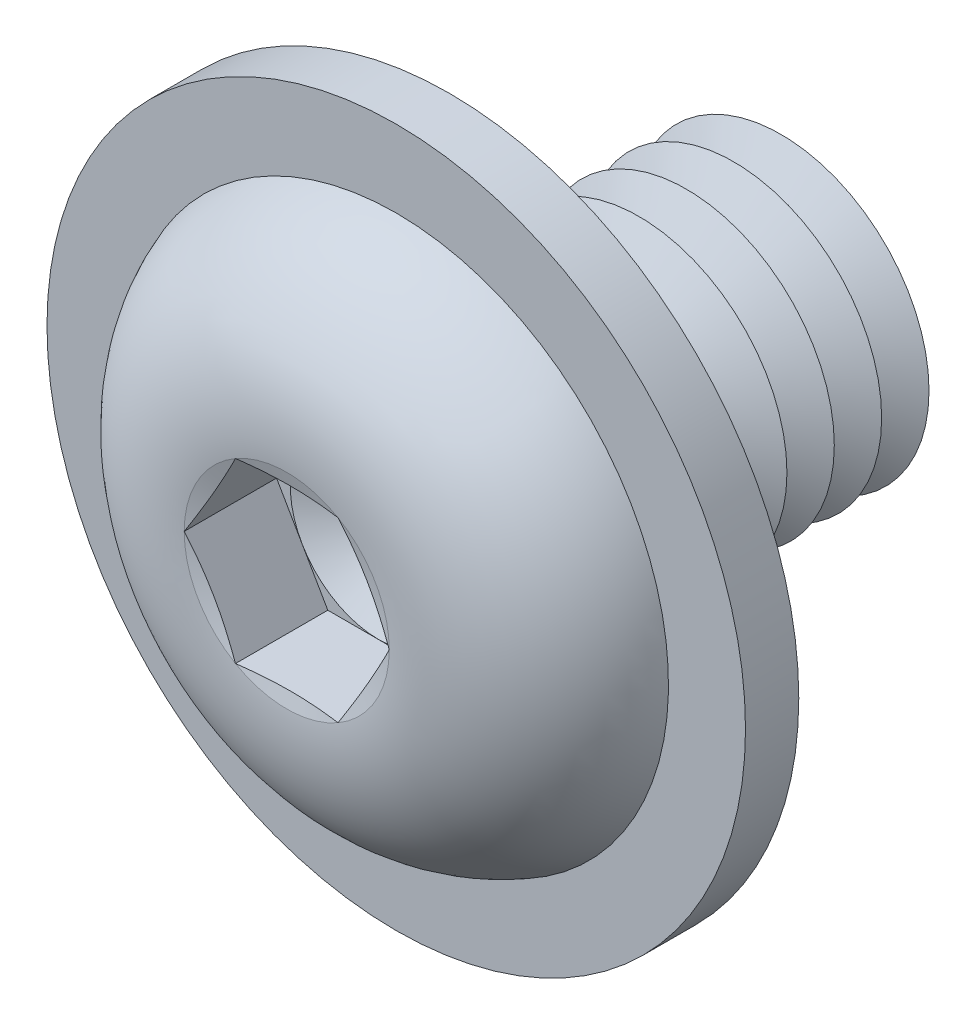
ISO-10303-21;
HEADER;
FILE_DESCRIPTION(('STEP AP214'),'2;1');
FILE_NAME('part.step','',(''),(''),'','','');
FILE_SCHEMA(('AUTOMOTIVE_DESIGN { 1 0 10303 214 1 1 1 1 }'));
ENDSEC;
DATA;
#1=APPLICATION_CONTEXT('core data for automotive mechanical design processes');
#2=APPLICATION_PROTOCOL_DEFINITION('international standard','automotive_design',2000,#1);
#3=PRODUCT_CONTEXT('',#1,'mechanical');
#4=PRODUCT('Part','Part','',(#3));
#5=PRODUCT_RELATED_PRODUCT_CATEGORY('part','',(#4));
#6=PRODUCT_DEFINITION_FORMATION('','',#4);
#7=PRODUCT_DEFINITION_CONTEXT('part definition',#1,'design');
#8=PRODUCT_DEFINITION('design','',#6,#7);
#9=PRODUCT_DEFINITION_SHAPE('','',#8);
#10=(LENGTH_UNIT() NAMED_UNIT(*) SI_UNIT(.MILLI.,.METRE.));
#11=(NAMED_UNIT(*) PLANE_ANGLE_UNIT() SI_UNIT($,.RADIAN.));
#12=(NAMED_UNIT(*) SI_UNIT($,.STERADIAN.) SOLID_ANGLE_UNIT());
#13=UNCERTAINTY_MEASURE_WITH_UNIT(LENGTH_MEASURE(1.E-05),#10,'distance_accuracy_value','');
#14=(GEOMETRIC_REPRESENTATION_CONTEXT(3) GLOBAL_UNCERTAINTY_ASSIGNED_CONTEXT((#13)) GLOBAL_UNIT_ASSIGNED_CONTEXT((#10,
#11,#12)) REPRESENTATION_CONTEXT('',''));
#15=CARTESIAN_POINT('',(0.,0.,0.));
#16=DIRECTION('',(0.,0.,1.));
#17=DIRECTION('',(1.,0.,0.));
#18=AXIS2_PLACEMENT_3D('',#15,#16,#17);
#19=CARTESIAN_POINT('',(0.,0.,-3.2));
#20=DIRECTION('',(0.,0.,1.));
#21=DIRECTION('',(1.,0.,0.));
#22=AXIS2_PLACEMENT_3D('',#19,#20,#21);
#23=CONICAL_SURFACE('',#22,2.5,1.0471975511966);
#24=CARTESIAN_POINT('',(0.,0.,-3.6));
#25=DIRECTION('',(0.,0.,1.));
#26=DIRECTION('',(1.,0.,0.));
#27=AXIS2_PLACEMENT_3D('',#24,#25,#26);
#28=CIRCLE('',#27,1.80717967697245);
#29=CARTESIAN_POINT('',(1.80717967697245,0.,-3.6));
#30=VERTEX_POINT('',#29);
#31=EDGE_CURVE('E265',#30,#30,#28,.T.);
#32=ORIENTED_EDGE('',*,*,#31,.T.);
#33=EDGE_LOOP('',(#32));
#34=FACE_BOUND('',#33,.T.);
#35=CARTESIAN_POINT('',(0.,0.,-3.2));
#36=DIRECTION('',(0.,0.,1.));
#37=DIRECTION('',(1.,0.,0.));
#38=AXIS2_PLACEMENT_3D('',#35,#36,#37);
#39=CIRCLE('',#38,2.5);
#40=CARTESIAN_POINT('',(2.5,0.,-3.2));
#41=VERTEX_POINT('',#40);
#42=EDGE_CURVE('E261',#41,#41,#39,.T.);
#43=ORIENTED_EDGE('',*,*,#42,.F.);
#44=EDGE_LOOP('',(#43));
#45=FACE_BOUND('',#44,.T.);
#46=ADVANCED_FACE('F39',(#34,#45),#23,.T.);
#47=CARTESIAN_POINT('',(0.,0.,-3.6));
#48=DIRECTION('',(0.,0.,-1.));
#49=DIRECTION('',(-1.,0.,0.));
#50=AXIS2_PLACEMENT_3D('',#47,#48,#49);
#51=CONICAL_SURFACE('',#50,1.80717967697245,1.0471975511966);
#52=CARTESIAN_POINT('',(0.,0.,-4.));
#53=DIRECTION('',(0.,0.,1.));
#54=DIRECTION('',(1.,0.,0.));
#55=AXIS2_PLACEMENT_3D('',#52,#53,#54);
#56=CIRCLE('',#55,2.5);
#57=CARTESIAN_POINT('',(2.5,0.,-4.));
#58=VERTEX_POINT('',#57);
#59=EDGE_CURVE('E269',#58,#58,#56,.T.);
#60=ORIENTED_EDGE('',*,*,#59,.T.);
#61=EDGE_LOOP('',(#60));
#62=FACE_BOUND('',#61,.T.);
#63=ORIENTED_EDGE('',*,*,#31,.F.);
#64=EDGE_LOOP('',(#63));
#65=FACE_BOUND('',#64,.T.);
#66=ADVANCED_FACE('F390',(#62,#65),#51,.T.);
#67=CARTESIAN_POINT('',(0.,2.5,-6.));
#68=DIRECTION('',(0.,0.,-1.));
#69=DIRECTION('',(-1.,0.,0.));
#70=AXIS2_PLACEMENT_3D('',#67,#68,#69);
#71=PLANE('',#70);
#72=CARTESIAN_POINT('',(0.,0.,-6.));
#73=DIRECTION('',(0.,0.,1.));
#74=DIRECTION('',(1.,0.,0.));
#75=AXIS2_PLACEMENT_3D('',#72,#73,#74);
#76=CIRCLE('',#75,1.80717967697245);
#77=CARTESIAN_POINT('',(1.80717967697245,0.,-6.));
#78=VERTEX_POINT('',#77);
#79=EDGE_CURVE('E289',#78,#78,#76,.T.);
#80=ORIENTED_EDGE('',*,*,#79,.F.);
#81=EDGE_LOOP('',(#80));
#82=FACE_BOUND('',#81,.T.);
#83=ADVANCED_FACE('F396',(#82),#71,.T.);
#84=CARTESIAN_POINT('',(0.,0.,-5.6));
#85=DIRECTION('',(0.,0.,1.));
#86=DIRECTION('',(1.,0.,0.));
#87=AXIS2_PLACEMENT_3D('',#84,#85,#86);
#88=CONICAL_SURFACE('',#87,2.5,1.0471975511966);
#89=ORIENTED_EDGE('',*,*,#79,.T.);
#90=EDGE_LOOP('',(#89));
#91=FACE_BOUND('',#90,.T.);
#92=CARTESIAN_POINT('',(0.,0.,-5.6));
#93=DIRECTION('',(0.,0.,1.));
#94=DIRECTION('',(1.,0.,0.));
#95=AXIS2_PLACEMENT_3D('',#92,#93,#94);
#96=CIRCLE('',#95,2.5);
#97=CARTESIAN_POINT('',(2.5,0.,-5.6));
#98=VERTEX_POINT('',#97);
#99=EDGE_CURVE('E285',#98,#98,#96,.T.);
#100=ORIENTED_EDGE('',*,*,#99,.F.);
#101=EDGE_LOOP('',(#100));
#102=FACE_BOUND('',#101,.T.);
#103=ADVANCED_FACE('F415',(#91,#102),#88,.T.);
#104=CARTESIAN_POINT('',(0.,0.,-5.2));
#105=DIRECTION('',(0.,0.,-1.));
#106=DIRECTION('',(-1.,0.,0.));
#107=AXIS2_PLACEMENT_3D('',#104,#105,#106);
#108=CONICAL_SURFACE('',#107,1.80717967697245,1.0471975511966);
#109=ORIENTED_EDGE('',*,*,#99,.T.);
#110=EDGE_LOOP('',(#109));
#111=FACE_BOUND('',#110,.T.);
#112=CARTESIAN_POINT('',(0.,0.,-5.2));
#113=DIRECTION('',(0.,0.,1.));
#114=DIRECTION('',(1.,0.,0.));
#115=AXIS2_PLACEMENT_3D('',#112,#113,#114);
#116=CIRCLE('',#115,1.80717967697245);
#117=CARTESIAN_POINT('',(1.80717967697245,0.,-5.2));
#118=VERTEX_POINT('',#117);
#119=EDGE_CURVE('E281',#118,#118,#116,.T.);
#120=ORIENTED_EDGE('',*,*,#119,.F.);
#121=EDGE_LOOP('',(#120));
#122=FACE_BOUND('',#121,.T.);
#123=ADVANCED_FACE('F412',(#111,#122),#108,.T.);
#124=CARTESIAN_POINT('',(0.,0.,-4.8));
#125=DIRECTION('',(0.,0.,1.));
#126=DIRECTION('',(1.,0.,0.));
#127=AXIS2_PLACEMENT_3D('',#124,#125,#126);
#128=CONICAL_SURFACE('',#127,2.5,1.0471975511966);
#129=ORIENTED_EDGE('',*,*,#119,.T.);
#130=EDGE_LOOP('',(#129));
#131=FACE_BOUND('',#130,.T.);
#132=CARTESIAN_POINT('',(0.,0.,-4.8));
#133=DIRECTION('',(0.,0.,1.));
#134=DIRECTION('',(1.,0.,0.));
#135=AXIS2_PLACEMENT_3D('',#132,#133,#134);
#136=CIRCLE('',#135,2.5);
#137=CARTESIAN_POINT('',(2.5,0.,-4.8));
#138=VERTEX_POINT('',#137);
#139=EDGE_CURVE('E277',#138,#138,#136,.T.);
#140=ORIENTED_EDGE('',*,*,#139,.F.);
#141=EDGE_LOOP('',(#140));
#142=FACE_BOUND('',#141,.T.);
#143=ADVANCED_FACE('F406',(#131,#142),#128,.T.);
#144=CARTESIAN_POINT('',(0.,0.,-4.4));
#145=DIRECTION('',(0.,0.,-1.));
#146=DIRECTION('',(-1.,0.,0.));
#147=AXIS2_PLACEMENT_3D('',#144,#145,#146);
#148=CONICAL_SURFACE('',#147,1.80717967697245,1.0471975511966);
#149=ORIENTED_EDGE('',*,*,#139,.T.);
#150=EDGE_LOOP('',(#149));
#151=FACE_BOUND('',#150,.T.);
#152=CARTESIAN_POINT('',(0.,0.,-4.4));
#153=DIRECTION('',(0.,0.,1.));
#154=DIRECTION('',(1.,0.,0.));
#155=AXIS2_PLACEMENT_3D('',#152,#153,#154);
#156=CIRCLE('',#155,1.80717967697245);
#157=CARTESIAN_POINT('',(1.80717967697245,0.,-4.4));
#158=VERTEX_POINT('',#157);
#159=EDGE_CURVE('E273',#158,#158,#156,.T.);
#160=ORIENTED_EDGE('',*,*,#159,.F.);
#161=EDGE_LOOP('',(#160));
#162=FACE_BOUND('',#161,.T.);
#163=ADVANCED_FACE('F402',(#151,#162),#148,.T.);
#164=CARTESIAN_POINT('',(0.,0.,-4.));
#165=DIRECTION('',(0.,0.,1.));
#166=DIRECTION('',(1.,0.,0.));
#167=AXIS2_PLACEMENT_3D('',#164,#165,#166);
#168=CONICAL_SURFACE('',#167,2.5,1.0471975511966);
#169=ORIENTED_EDGE('',*,*,#159,.T.);
#170=EDGE_LOOP('',(#169));
#171=FACE_BOUND('',#170,.T.);
#172=ORIENTED_EDGE('',*,*,#59,.F.);
#173=EDGE_LOOP('',(#172));
#174=FACE_BOUND('',#173,.T.);
#175=ADVANCED_FACE('F405',(#171,#174),#168,.T.);
#176=CARTESIAN_POINT('',(0.,0.,-2.4));
#177=DIRECTION('',(0.,0.,1.));
#178=DIRECTION('',(1.,0.,0.));
#179=AXIS2_PLACEMENT_3D('',#176,#177,#178);
#180=CONICAL_SURFACE('',#179,2.5,1.0471975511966);
#181=CARTESIAN_POINT('',(0.,0.,-2.8));
#182=DIRECTION('',(0.,0.,1.));
#183=DIRECTION('',(1.,0.,0.));
#184=AXIS2_PLACEMENT_3D('',#181,#182,#183);
#185=CIRCLE('',#184,1.80717967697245);
#186=CARTESIAN_POINT('',(1.80717967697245,0.,-2.8));
#187=VERTEX_POINT('',#186);
#188=EDGE_CURVE('E257',#187,#187,#185,.T.);
#189=ORIENTED_EDGE('',*,*,#188,.T.);
#190=EDGE_LOOP('',(#189));
#191=FACE_BOUND('',#190,.T.);
#192=CARTESIAN_POINT('',(0.,0.,-2.4));
#193=DIRECTION('',(0.,0.,1.));
#194=DIRECTION('',(1.,0.,0.));
#195=AXIS2_PLACEMENT_3D('',#192,#193,#194);
#196=CIRCLE('',#195,2.5);
#197=CARTESIAN_POINT('',(2.5,0.,-2.4));
#198=VERTEX_POINT('',#197);
#199=EDGE_CURVE('E253',#198,#198,#196,.T.);
#200=ORIENTED_EDGE('',*,*,#199,.F.);
#201=EDGE_LOOP('',(#200));
#202=FACE_BOUND('',#201,.T.);
#203=ADVANCED_FACE('F410',(#191,#202),#180,.T.);
#204=CARTESIAN_POINT('',(0.,0.,-2.8));
#205=DIRECTION('',(0.,0.,-1.));
#206=DIRECTION('',(-1.,0.,0.));
#207=AXIS2_PLACEMENT_3D('',#204,#205,#206);
#208=CONICAL_SURFACE('',#207,1.80717967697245,1.0471975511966);
#209=ORIENTED_EDGE('',*,*,#42,.T.);
#210=EDGE_LOOP('',(#209));
#211=FACE_BOUND('',#210,.T.);
#212=ORIENTED_EDGE('',*,*,#188,.F.);
#213=EDGE_LOOP('',(#212));
#214=FACE_BOUND('',#213,.T.);
#215=ADVANCED_FACE('F461',(#211,#214),#208,.T.);
#216=CARTESIAN_POINT('',(0.,0.,-1.6));
#217=DIRECTION('',(0.,0.,1.));
#218=DIRECTION('',(1.,0.,0.));
#219=AXIS2_PLACEMENT_3D('',#216,#217,#218);
#220=CONICAL_SURFACE('',#219,2.5,1.0471975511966);
#221=CARTESIAN_POINT('',(0.,0.,-2.));
#222=DIRECTION('',(0.,0.,1.));
#223=DIRECTION('',(1.,0.,0.));
#224=AXIS2_PLACEMENT_3D('',#221,#222,#223);
#225=CIRCLE('',#224,1.80717967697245);
#226=CARTESIAN_POINT('',(1.80717967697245,0.,-2.));
#227=VERTEX_POINT('',#226);
#228=EDGE_CURVE('E249',#227,#227,#225,.T.);
#229=ORIENTED_EDGE('',*,*,#228,.T.);
#230=EDGE_LOOP('',(#229));
#231=FACE_BOUND('',#230,.T.);
#232=CARTESIAN_POINT('',(0.,0.,-1.6));
#233=DIRECTION('',(0.,0.,1.));
#234=DIRECTION('',(1.,0.,0.));
#235=AXIS2_PLACEMENT_3D('',#232,#233,#234);
#236=CIRCLE('',#235,2.5);
#237=CARTESIAN_POINT('',(2.5,0.,-1.6));
#238=VERTEX_POINT('',#237);
#239=EDGE_CURVE('E241',#238,#238,#236,.T.);
#240=ORIENTED_EDGE('',*,*,#239,.F.);
#241=EDGE_LOOP('',(#240));
#242=FACE_BOUND('',#241,.T.);
#243=ADVANCED_FACE('F467',(#231,#242),#220,.T.);
#244=CARTESIAN_POINT('',(0.,0.,-2.));
#245=DIRECTION('',(0.,0.,-1.));
#246=DIRECTION('',(-1.,0.,0.));
#247=AXIS2_PLACEMENT_3D('',#244,#245,#246);
#248=CONICAL_SURFACE('',#247,1.80717967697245,1.0471975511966);
#249=ORIENTED_EDGE('',*,*,#199,.T.);
#250=EDGE_LOOP('',(#249));
#251=FACE_BOUND('',#250,.T.);
#252=ORIENTED_EDGE('',*,*,#228,.F.);
#253=EDGE_LOOP('',(#252));
#254=FACE_BOUND('',#253,.T.);
#255=ADVANCED_FACE('F474',(#251,#254),#248,.T.);
#256=CARTESIAN_POINT('',(0.,0.,-0.799999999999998));
#257=DIRECTION('',(0.,0.,1.));
#258=DIRECTION('',(1.,0.,0.));
#259=AXIS2_PLACEMENT_3D('',#256,#257,#258);
#260=CONICAL_SURFACE('',#259,2.5,1.0471975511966);
#261=CARTESIAN_POINT('',(0.,0.,-1.2));
#262=DIRECTION('',(0.,0.,1.));
#263=DIRECTION('',(1.,0.,0.));
#264=AXIS2_PLACEMENT_3D('',#261,#262,#263);
#265=CIRCLE('',#264,1.80717967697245);
#266=CARTESIAN_POINT('',(1.80717967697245,0.,-1.2));
#267=VERTEX_POINT('',#266);
#268=EDGE_CURVE('E230',#267,#267,#265,.T.);
#269=ORIENTED_EDGE('',*,*,#268,.T.);
#270=EDGE_LOOP('',(#269));
#271=FACE_BOUND('',#270,.T.);
#272=CARTESIAN_POINT('',(0.,0.,-0.799999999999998));
#273=DIRECTION('',(0.,0.,1.));
#274=DIRECTION('',(1.,0.,0.));
#275=AXIS2_PLACEMENT_3D('',#272,#273,#274);
#276=CIRCLE('',#275,2.5);
#277=CARTESIAN_POINT('',(2.5,0.,-0.799999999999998));
#278=VERTEX_POINT('',#277);
#279=EDGE_CURVE('E245',#278,#278,#276,.T.);
#280=ORIENTED_EDGE('',*,*,#279,.F.);
#281=EDGE_LOOP('',(#280));
#282=FACE_BOUND('',#281,.T.);
#283=ADVANCED_FACE('F481',(#271,#282),#260,.T.);
#284=CARTESIAN_POINT('',(0.,0.,-1.2));
#285=DIRECTION('',(0.,0.,-1.));
#286=DIRECTION('',(-1.,0.,0.));
#287=AXIS2_PLACEMENT_3D('',#284,#285,#286);
#288=CONICAL_SURFACE('',#287,1.80717967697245,1.0471975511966);
#289=ORIENTED_EDGE('',*,*,#239,.T.);
#290=EDGE_LOOP('',(#289));
#291=FACE_BOUND('',#290,.T.);
#292=ORIENTED_EDGE('',*,*,#268,.F.);
#293=EDGE_LOOP('',(#292));
#294=FACE_BOUND('',#293,.T.);
#295=ADVANCED_FACE('F219',(#291,#294),#288,.T.);
#296=CARTESIAN_POINT('',(0.,2.5,0.));
#297=DIRECTION('',(0.,0.,-1.));
#298=DIRECTION('',(-1.,0.,0.));
#299=AXIS2_PLACEMENT_3D('',#296,#297,#298);
#300=PLANE('',#299);
#301=CARTESIAN_POINT('',(0.,0.,0.));
#302=DIRECTION('',(0.,0.,-1.));
#303=DIRECTION('',(-1.,0.,0.));
#304=AXIS2_PLACEMENT_3D('',#301,#302,#303);
#305=CIRCLE('',#304,2.9);
#306=CARTESIAN_POINT('',(-2.9,0.,0.));
#307=VERTEX_POINT('',#306);
#308=EDGE_CURVE('E303',#307,#307,#305,.F.);
#309=ORIENTED_EDGE('',*,*,#308,.T.);
#310=EDGE_LOOP('',(#309));
#311=FACE_BOUND('',#310,.T.);
#312=CARTESIAN_POINT('',(0.,0.,0.));
#313=DIRECTION('',(0.,0.,-1.));
#314=DIRECTION('',(0.,1.,0.));
#315=AXIS2_PLACEMENT_3D('',#312,#313,#314);
#316=CIRCLE('',#315,5.9);
#317=CARTESIAN_POINT('',(0.,5.9,0.));
#318=VERTEX_POINT('',#317);
#319=EDGE_CURVE('E366',#318,#318,#316,.T.);
#320=ORIENTED_EDGE('',*,*,#319,.T.);
#321=EDGE_LOOP('',(#320));
#322=FACE_BOUND('',#321,.T.);
#323=ADVANCED_FACE('F376',(#311,#322),#300,.T.);
#324=CARTESIAN_POINT('',(0.,0.,-0.399999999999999));
#325=DIRECTION('',(0.,0.,-1.));
#326=DIRECTION('',(-1.,0.,0.));
#327=AXIS2_PLACEMENT_3D('',#324,#325,#326);
#328=TOROIDAL_SURFACE('',#327,2.9,0.4);
#329=ORIENTED_EDGE('',*,*,#308,.F.);
#330=EDGE_LOOP('',(#329));
#331=FACE_BOUND('',#330,.T.);
#332=CARTESIAN_POINT('',(0.,0.,-0.399999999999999));
#333=DIRECTION('',(0.,0.,-1.));
#334=DIRECTION('',(-1.,0.,0.));
#335=AXIS2_PLACEMENT_3D('',#332,#333,#334);
#336=CIRCLE('',#335,2.5);
#337=CARTESIAN_POINT('',(-2.5,0.,-0.399999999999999));
#338=VERTEX_POINT('',#337);
#339=EDGE_CURVE('E298',#338,#338,#336,.T.);
#340=ORIENTED_EDGE('',*,*,#339,.F.);
#341=EDGE_LOOP('',(#340));
#342=FACE_BOUND('',#341,.T.);
#343=ADVANCED_FACE('F41',(#331,#342),#328,.F.);
#344=CARTESIAN_POINT('',(0.,0.,-6.));
#345=DIRECTION('',(0.,0.,-1.));
#346=DIRECTION('',(-1.,0.,0.));
#347=AXIS2_PLACEMENT_3D('',#344,#345,#346);
#348=CYLINDRICAL_SURFACE('',#347,2.5);
#349=ORIENTED_EDGE('',*,*,#339,.T.);
#350=EDGE_LOOP('',(#349));
#351=FACE_BOUND('',#350,.T.);
#352=ORIENTED_EDGE('',*,*,#279,.T.);
#353=EDGE_LOOP('',(#352));
#354=FACE_BOUND('',#353,.T.);
#355=ADVANCED_FACE('F380',(#351,#354),#348,.T.);
#356=CARTESIAN_POINT('',(0.,0.,0.9));
#357=DIRECTION('',(0.,0.,-1.));
#358=DIRECTION('',(0.,1.,0.));
#359=AXIS2_PLACEMENT_3D('',#356,#357,#358);
#360=CYLINDRICAL_SURFACE('',#359,5.9);
#361=CARTESIAN_POINT('',(0.,0.,0.9));
#362=DIRECTION('',(0.,0.,-1.));
#363=DIRECTION('',(0.,1.,0.));
#364=AXIS2_PLACEMENT_3D('',#361,#362,#363);
#365=CIRCLE('',#364,5.9);
#366=CARTESIAN_POINT('',(0.,5.9,0.9));
#367=VERTEX_POINT('',#366);
#368=EDGE_CURVE('E362',#367,#367,#365,.T.);
#369=ORIENTED_EDGE('',*,*,#368,.T.);
#370=EDGE_LOOP('',(#369));
#371=FACE_BOUND('',#370,.T.);
#372=ORIENTED_EDGE('',*,*,#319,.F.);
#373=EDGE_LOOP('',(#372));
#374=FACE_BOUND('',#373,.T.);
#375=ADVANCED_FACE('F378',(#371,#374),#360,.T.);
#376=CARTESIAN_POINT('',(0.,0.,0.9));
#377=DIRECTION('',(0.,0.,-1.));
#378=DIRECTION('',(0.,1.,0.));
#379=AXIS2_PLACEMENT_3D('',#376,#377,#378);
#380=PLANE('',#379);
#381=CARTESIAN_POINT('',(0.,0.,0.9));
#382=DIRECTION('',(0.,0.,-1.));
#383=DIRECTION('',(0.,1.,0.));
#384=AXIS2_PLACEMENT_3D('',#381,#382,#383);
#385=CIRCLE('',#384,4.59924727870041);
#386=CARTESIAN_POINT('',(0.,4.59924727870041,0.9));
#387=VERTEX_POINT('',#386);
#388=EDGE_CURVE('E43',#387,#387,#385,.F.);
#389=ORIENTED_EDGE('',*,*,#388,.F.);
#390=EDGE_LOOP('',(#389));
#391=FACE_BOUND('',#390,.T.);
#392=ORIENTED_EDGE('',*,*,#368,.F.);
#393=EDGE_LOOP('',(#392));
#394=FACE_BOUND('',#393,.T.);
#395=ADVANCED_FACE('F117',(#391,#394),#380,.F.);
#396=CARTESIAN_POINT('',(0.,0.,1.19));
#397=DIRECTION('',(0.,0.,1.));
#398=DIRECTION('',(1.,0.,0.));
#399=AXIS2_PLACEMENT_3D('',#396,#397,#398);
#400=CONICAL_SURFACE('',#399,1.49999930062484,1.0471975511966);
#401=CARTESIAN_POINT('',(0.,0.,0.323975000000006));
#402=VERTEX_POINT('',#401);
#403=VERTEX_LOOP('',#402);
#404=FACE_BOUND('',#403,.T.);
#405=CARTESIAN_POINT('',(0.,0.,1.19));
#406=DIRECTION('',(0.,0.,1.));
#407=DIRECTION('',(1.,0.,0.));
#408=AXIS2_PLACEMENT_3D('',#405,#406,#407);
#409=CIRCLE('',#408,1.49999930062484);
#410=CARTESIAN_POINT('',(1.2990375,0.749999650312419,1.19));
#411=VERTEX_POINT('',#410);
#412=CARTESIAN_POINT('',(0.,1.49999930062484,1.19));
#413=VERTEX_POINT('',#412);
#414=EDGE_CURVE('E120',#411,#413,#409,.T.);
#415=ORIENTED_EDGE('',*,*,#414,.T.);
#416=CARTESIAN_POINT('',(0.,0.,1.19));
#417=DIRECTION('',(0.,0.,1.));
#418=DIRECTION('',(1.,0.,0.));
#419=AXIS2_PLACEMENT_3D('',#416,#417,#418);
#420=CIRCLE('',#419,1.49999930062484);
#421=CARTESIAN_POINT('',(-1.2990375,0.749999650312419,1.19));
#422=VERTEX_POINT('',#421);
#423=EDGE_CURVE('E11',#413,#422,#420,.T.);
#424=ORIENTED_EDGE('',*,*,#423,.T.);
#425=CARTESIAN_POINT('',(-1.2990375,-0.749999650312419,1.19));
#426=VERTEX_POINT('',#425);
#427=EDGE_CURVE('E49',#422,#426,#420,.T.);
#428=ORIENTED_EDGE('',*,*,#427,.T.);
#429=CARTESIAN_POINT('',(0.,-1.49999930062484,1.19));
#430=VERTEX_POINT('',#429);
#431=EDGE_CURVE('E309',#426,#430,#420,.T.);
#432=ORIENTED_EDGE('',*,*,#431,.T.);
#433=CARTESIAN_POINT('',(1.2990375,-0.749999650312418,1.19));
#434=VERTEX_POINT('',#433);
#435=EDGE_CURVE('E57',#430,#434,#420,.T.);
#436=ORIENTED_EDGE('',*,*,#435,.T.);
#437=EDGE_CURVE('E50',#434,#411,#420,.T.);
#438=ORIENTED_EDGE('',*,*,#437,.T.);
#439=EDGE_LOOP('',(#415,#424,#428,#432,#436,#438));
#440=FACE_BOUND('',#439,.T.);
#441=ADVANCED_FACE('F114',(#404,#440),#400,.F.);
#442=CARTESIAN_POINT('',(0.,0.,1.19));
#443=DIRECTION('',(0.,0.,1.));
#444=DIRECTION('',(1.,0.,0.));
#445=AXIS2_PLACEMENT_3D('',#442,#443,#444);
#446=PLANE('',#445);
#447=ORIENTED_EDGE('',*,*,#431,.F.);
#448=DIRECTION('',(0.5,-0.866025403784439,0.));
#449=VECTOR('',#448,1.);
#450=CARTESIAN_POINT('',(-1.73205,0.,1.19));
#451=LINE('',#450,#449);
#452=CARTESIAN_POINT('',(-0.866025,-1.49999930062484,1.19));
#453=VERTEX_POINT('',#452);
#454=EDGE_CURVE('E154',#426,#453,#451,.T.);
#455=ORIENTED_EDGE('',*,*,#454,.T.);
#456=DIRECTION('',(1.,0.,0.));
#457=VECTOR('',#456,1.);
#458=CARTESIAN_POINT('',(-0.866025,-1.49999930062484,1.19));
#459=LINE('',#458,#457);
#460=EDGE_CURVE('E160',#453,#430,#459,.T.);
#461=ORIENTED_EDGE('',*,*,#460,.T.);
#462=EDGE_LOOP('',(#447,#455,#461));
#463=FACE_BOUND('',#462,.T.);
#464=ADVANCED_FACE('F116',(#463),#446,.T.);
#465=ORIENTED_EDGE('',*,*,#435,.F.);
#466=CARTESIAN_POINT('',(0.866024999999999,-1.49999930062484,1.19));
#467=VERTEX_POINT('',#466);
#468=EDGE_CURVE('E159',#430,#467,#459,.T.);
#469=ORIENTED_EDGE('',*,*,#468,.T.);
#470=DIRECTION('',(0.5,0.866025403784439,0.));
#471=VECTOR('',#470,1.);
#472=CARTESIAN_POINT('',(0.866024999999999,-1.49999930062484,1.19));
#473=LINE('',#472,#471);
#474=EDGE_CURVE('E165',#467,#434,#473,.T.);
#475=ORIENTED_EDGE('',*,*,#474,.T.);
#476=EDGE_LOOP('',(#465,#469,#475));
#477=FACE_BOUND('',#476,.T.);
#478=ADVANCED_FACE('F530',(#477),#446,.T.);
#479=ORIENTED_EDGE('',*,*,#437,.F.);
#480=CARTESIAN_POINT('',(1.73205,0.,1.19));
#481=VERTEX_POINT('',#480);
#482=EDGE_CURVE('E164',#434,#481,#473,.T.);
#483=ORIENTED_EDGE('',*,*,#482,.T.);
#484=DIRECTION('',(-0.5,0.866025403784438,0.));
#485=VECTOR('',#484,1.);
#486=CARTESIAN_POINT('',(1.73205,0.,1.19));
#487=LINE('',#486,#485);
#488=EDGE_CURVE('E142',#481,#411,#487,.T.);
#489=ORIENTED_EDGE('',*,*,#488,.T.);
#490=EDGE_LOOP('',(#479,#483,#489));
#491=FACE_BOUND('',#490,.T.);
#492=ADVANCED_FACE('F539',(#491),#446,.T.);
#493=ORIENTED_EDGE('',*,*,#414,.F.);
#494=CARTESIAN_POINT('',(0.866025,1.49999930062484,1.19));
#495=VERTEX_POINT('',#494);
#496=EDGE_CURVE('E127',#411,#495,#487,.T.);
#497=ORIENTED_EDGE('',*,*,#496,.T.);
#498=DIRECTION('',(-1.,0.,0.));
#499=VECTOR('',#498,1.);
#500=CARTESIAN_POINT('',(0.866025,1.49999930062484,1.19));
#501=LINE('',#500,#499);
#502=EDGE_CURVE('E138',#495,#413,#501,.T.);
#503=ORIENTED_EDGE('',*,*,#502,.T.);
#504=EDGE_LOOP('',(#493,#497,#503));
#505=FACE_BOUND('',#504,.T.);
#506=ADVANCED_FACE('F144',(#505),#446,.T.);
#507=ORIENTED_EDGE('',*,*,#423,.F.);
#508=CARTESIAN_POINT('',(-0.866025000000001,1.49999930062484,1.19));
#509=VERTEX_POINT('',#508);
#510=EDGE_CURVE('E133',#413,#509,#501,.T.);
#511=ORIENTED_EDGE('',*,*,#510,.T.);
#512=DIRECTION('',(-0.5,-0.866025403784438,0.));
#513=VECTOR('',#512,1.);
#514=CARTESIAN_POINT('',(-0.866025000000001,1.49999930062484,1.19));
#515=LINE('',#514,#513);
#516=EDGE_CURVE('E136',#509,#422,#515,.T.);
#517=ORIENTED_EDGE('',*,*,#516,.T.);
#518=EDGE_LOOP('',(#507,#511,#517));
#519=FACE_BOUND('',#518,.T.);
#520=ADVANCED_FACE('F132',(#519),#446,.T.);
#521=ORIENTED_EDGE('',*,*,#427,.F.);
#522=CARTESIAN_POINT('',(-1.73205,0.,1.19));
#523=VERTEX_POINT('',#522);
#524=EDGE_CURVE('E146',#422,#523,#515,.T.);
#525=ORIENTED_EDGE('',*,*,#524,.T.);
#526=EDGE_CURVE('E155',#523,#426,#451,.T.);
#527=ORIENTED_EDGE('',*,*,#526,.T.);
#528=EDGE_LOOP('',(#521,#525,#527));
#529=FACE_BOUND('',#528,.T.);
#530=ADVANCED_FACE('F324',(#529),#446,.T.);
#531=CARTESIAN_POINT('',(-1.73205,0.,1.19));
#532=DIRECTION('',(-0.866025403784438,-0.5,0.));
#533=DIRECTION('',(0.5,-0.866025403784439,0.));
#534=AXIS2_PLACEMENT_3D('',#531,#532,#533);
#535=PLANE('',#534);
#536=CARTESIAN_POINT('',(-1.73216547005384,0.000200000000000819,2.75003094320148));
#537=CARTESIAN_POINT('',(-1.69619207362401,-0.0621077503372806,2.74038633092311));
#538=CARTESIAN_POINT('',(-1.66015343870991,-0.124528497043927,2.73163050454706));
#539=CARTESIAN_POINT('',(-1.58794885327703,-0.249590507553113,2.71624720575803));
#540=CARTESIAN_POINT('',(-1.55178285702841,-0.312231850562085,2.70962059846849));
#541=CARTESIAN_POINT('',(-1.47954289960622,-0.437355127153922,2.69888271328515));
#542=CARTESIAN_POINT('',(-1.4434694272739,-0.499836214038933,2.69475862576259));
#543=CARTESIAN_POINT('',(-1.37127646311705,-0.624878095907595,2.68922863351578));
#544=CARTESIAN_POINT('',(-1.33515698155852,-0.687438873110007,2.68782220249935));
#545=CARTESIAN_POINT('',(-1.26291801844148,-0.812560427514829,2.68782220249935));
#546=CARTESIAN_POINT('',(-1.22679853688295,-0.875121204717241,2.68922863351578));
#547=CARTESIAN_POINT('',(-1.1546055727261,-1.0001630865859,2.69475862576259));
#548=CARTESIAN_POINT('',(-1.11853210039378,-1.06264417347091,2.69888271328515));
#549=CARTESIAN_POINT('',(-1.0462921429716,-1.18776745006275,2.70962059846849));
#550=CARTESIAN_POINT('',(-1.01012614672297,-1.25040879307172,2.71624720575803));
#551=CARTESIAN_POINT('',(-0.937921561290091,-1.37547080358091,2.73163050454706));
#552=CARTESIAN_POINT('',(-0.901882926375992,-1.43789155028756,2.74038633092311));
#553=CARTESIAN_POINT('',(-0.865909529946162,-1.50019930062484,2.75003094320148));
#554=B_SPLINE_CURVE_WITH_KNOTS('',3,(#536,#537,#538,#539,#540,#541,#542,#543,#544,#545,#546,
#547,#548,#549,#550,#551,#552,#553),.UNSPECIFIED.,.F.,.F.,(4,2,2,2,2,2,2,2,4),(0.,
0.217782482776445,0.435653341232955,0.652399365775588,0.869103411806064,1.08580745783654,
1.30255348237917,1.52042434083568,1.73820682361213),.UNSPECIFIED.);
#555=CARTESIAN_POINT('',(-1.73205,0.,2.75));
#556=VERTEX_POINT('',#555);
#557=CARTESIAN_POINT('',(-0.866025,-1.49999930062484,2.75));
#558=VERTEX_POINT('',#557);
#559=EDGE_CURVE('E329',#556,#558,#554,.T.);
#560=ORIENTED_EDGE('',*,*,#559,.T.);
#561=DIRECTION('',(0.,0.,1.));
#562=VECTOR('',#561,1.);
#563=CARTESIAN_POINT('',(-0.866025,-1.49999930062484,1.19));
#564=LINE('',#563,#562);
#565=EDGE_CURVE('E176',#453,#558,#564,.T.);
#566=ORIENTED_EDGE('',*,*,#565,.F.);
#567=ORIENTED_EDGE('',*,*,#454,.F.);
#568=ORIENTED_EDGE('',*,*,#526,.F.);
#569=DIRECTION('',(0.,0.,1.));
#570=VECTOR('',#569,1.);
#571=CARTESIAN_POINT('',(-1.73205,0.,1.19));
#572=LINE('',#571,#570);
#573=EDGE_CURVE('E180',#523,#556,#572,.T.);
#574=ORIENTED_EDGE('',*,*,#573,.T.);
#575=EDGE_LOOP('',(#560,#566,#567,#568,#574));
#576=FACE_BOUND('',#575,.T.);
#577=ADVANCED_FACE('F322',(#576),#535,.F.);
#578=CARTESIAN_POINT('',(-0.866025,-1.49999930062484,1.19));
#579=DIRECTION('',(0.,-1.,0.));
#580=DIRECTION('',(0.,0.,-1.));
#581=AXIS2_PLACEMENT_3D('',#578,#579,#580);
#582=PLANE('',#581);
#583=CARTESIAN_POINT('',(-2.61375031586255,-1.49999930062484,3.09338600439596));
#584=CARTESIAN_POINT('',(-2.48719895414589,-1.49999930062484,3.06401688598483));
#585=CARTESIAN_POINT('',(-2.36054180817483,-1.49999930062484,3.03507426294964));
#586=CARTESIAN_POINT('',(-2.10688190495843,-1.49999930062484,2.97862489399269));
#587=CARTESIAN_POINT('',(-1.97987908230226,-1.49999930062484,2.95111844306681));
#588=CARTESIAN_POINT('',(-1.72425281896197,-1.49999930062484,2.89788845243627));
#589=CARTESIAN_POINT('',(-1.59562534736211,-1.49999930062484,2.87218404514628));
#590=CARTESIAN_POINT('',(-1.33776732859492,-1.49999930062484,2.82387586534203));
#591=CARTESIAN_POINT('',(-1.20853672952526,-1.49999930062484,2.80127236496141));
#592=CARTESIAN_POINT('',(-0.952831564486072,-1.49999930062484,2.76126658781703));
#593=CARTESIAN_POINT('',(-0.826376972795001,-1.49999930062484,2.74374018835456));
#594=CARTESIAN_POINT('',(-0.572755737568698,-1.49999930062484,2.71502809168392));
#595=CARTESIAN_POINT('',(-0.445589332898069,-1.49999930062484,2.70384038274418));
#596=CARTESIAN_POINT('',(-0.191333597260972,-1.49999930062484,2.68972083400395));
#597=CARTESIAN_POINT('',(-0.0642464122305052,-1.49999930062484,2.68675270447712));
#598=CARTESIAN_POINT('',(0.189835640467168,-1.49999930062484,2.68959577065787));
#599=CARTESIAN_POINT('',(0.316830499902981,-1.49999930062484,2.69540767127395));
#600=CARTESIAN_POINT('',(0.534182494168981,-1.49999930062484,2.71190493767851));
#601=CARTESIAN_POINT('',(0.624691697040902,-1.49999930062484,2.72073513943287));
#602=CARTESIAN_POINT('',(0.805336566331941,-1.49999930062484,2.74156379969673));
#603=CARTESIAN_POINT('',(0.895472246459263,-1.49999930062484,2.75356214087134));
#604=CARTESIAN_POINT('',(1.0756572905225,-1.49999930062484,2.78006977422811));
#605=CARTESIAN_POINT('',(1.16570548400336,-1.49999930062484,2.7945868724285));
#606=CARTESIAN_POINT('',(1.3454787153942,-1.49999930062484,2.82550612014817));
#607=CARTESIAN_POINT('',(1.43520373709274,-1.49999930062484,2.8419083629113));
#608=CARTESIAN_POINT('',(1.61622412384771,-1.49999930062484,2.87648604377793));
#609=CARTESIAN_POINT('',(1.70751379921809,-1.49999930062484,2.89469103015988));
#610=CARTESIAN_POINT('',(1.88986344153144,-1.49999930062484,2.93221618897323));
#611=CARTESIAN_POINT('',(1.98092340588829,-1.49999930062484,2.95153637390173));
#612=CARTESIAN_POINT('',(2.16236354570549,-1.49999930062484,2.99091506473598));
#613=CARTESIAN_POINT('',(2.25274472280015,-1.49999930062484,3.01096897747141));
#614=CARTESIAN_POINT('',(2.43335289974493,-1.49999930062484,3.05173139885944));
#615=CARTESIAN_POINT('',(2.52357990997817,-1.49999930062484,3.07243986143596));
#616=CARTESIAN_POINT('',(2.61375031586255,-1.49999930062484,3.09338600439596));
#617=B_SPLINE_CURVE_WITH_KNOTS('',3,(#583,#584,#585,#586,#587,#588,#589,#590,#591,#592,#593,
#594,#595,#596,#597,#598,#599,#600,#601,#602,#603,#604,#605,#606,#607,#608,#609,#610,#611,#612,
#613,#614,#615,#616),.UNSPECIFIED.,.F.,.F.,(4,2,2,2,2,2,2,2,2,2,2,2,2,2,2,2,4),(0.,
0.389753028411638,0.779585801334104,1.17307326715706,1.5665952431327,1.94947555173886,
2.33223427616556,2.71330039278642,3.09439710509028,3.36715350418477,3.63989980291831,
3.91350699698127,4.18712773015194,4.4663802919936,4.74563598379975,5.02337106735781,
5.30108664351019),.UNSPECIFIED.);
#618=CARTESIAN_POINT('',(0.866024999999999,-1.49999930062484,2.75));
#619=VERTEX_POINT('',#618);
#620=EDGE_CURVE('E336',#558,#619,#617,.T.);
#621=ORIENTED_EDGE('',*,*,#620,.T.);
#622=DIRECTION('',(0.,0.,1.));
#623=VECTOR('',#622,1.);
#624=CARTESIAN_POINT('',(0.866024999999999,-1.49999930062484,1.19));
#625=LINE('',#624,#623);
#626=EDGE_CURVE('E172',#467,#619,#625,.T.);
#627=ORIENTED_EDGE('',*,*,#626,.F.);
#628=ORIENTED_EDGE('',*,*,#468,.F.);
#629=ORIENTED_EDGE('',*,*,#460,.F.);
#630=ORIENTED_EDGE('',*,*,#565,.T.);
#631=EDGE_LOOP('',(#621,#627,#628,#629,#630));
#632=FACE_BOUND('',#631,.T.);
#633=ADVANCED_FACE('F573',(#632),#582,.F.);
#634=CARTESIAN_POINT('',(0.866024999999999,-1.49999930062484,1.19));
#635=DIRECTION('',(0.866025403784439,-0.5,0.));
#636=DIRECTION('',(0.5,0.866025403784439,0.));
#637=AXIS2_PLACEMENT_3D('',#634,#635,#636);
#638=PLANE('',#637);
#639=CARTESIAN_POINT('',(0.865909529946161,-1.50019930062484,2.75003094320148));
#640=CARTESIAN_POINT('',(0.90188292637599,-1.43789155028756,2.74038633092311));
#641=CARTESIAN_POINT('',(0.93792156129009,-1.37547080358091,2.73163050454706));
#642=CARTESIAN_POINT('',(1.01012614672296,-1.25040879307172,2.71624720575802));
#643=CARTESIAN_POINT('',(1.04629214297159,-1.18776745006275,2.70962059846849));
#644=CARTESIAN_POINT('',(1.11853210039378,-1.06264417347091,2.69888271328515));
#645=CARTESIAN_POINT('',(1.1546055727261,-1.0001630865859,2.69475862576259));
#646=CARTESIAN_POINT('',(1.22679853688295,-0.87512120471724,2.68922863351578));
#647=CARTESIAN_POINT('',(1.26291801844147,-0.812560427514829,2.68782220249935));
#648=CARTESIAN_POINT('',(1.33515698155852,-0.687438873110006,2.68782220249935));
#649=CARTESIAN_POINT('',(1.37127646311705,-0.624878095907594,2.68922863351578));
#650=CARTESIAN_POINT('',(1.4434694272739,-0.499836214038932,2.69475862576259));
#651=CARTESIAN_POINT('',(1.47954289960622,-0.437355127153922,2.69888271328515));
#652=CARTESIAN_POINT('',(1.5517828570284,-0.312231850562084,2.70962059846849));
#653=CARTESIAN_POINT('',(1.58794885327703,-0.249590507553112,2.71624720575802));
#654=CARTESIAN_POINT('',(1.66015343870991,-0.124528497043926,2.73163050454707));
#655=CARTESIAN_POINT('',(1.69619207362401,-0.0621077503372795,2.74038633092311));
#656=CARTESIAN_POINT('',(1.73216547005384,0.000200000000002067,2.75003094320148));
#657=B_SPLINE_CURVE_WITH_KNOTS('',3,(#639,#640,#641,#642,#643,#644,#645,#646,#647,#648,#649,
#650,#651,#652,#653,#654,#655,#656),.UNSPECIFIED.,.F.,.F.,(4,2,2,2,2,2,2,2,4),(0.,
0.217782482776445,0.435653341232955,0.652399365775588,0.869103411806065,1.08580745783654,
1.30255348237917,1.52042434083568,1.73820682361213),.UNSPECIFIED.);
#658=CARTESIAN_POINT('',(1.73205,0.,2.75));
#659=VERTEX_POINT('',#658);
#660=EDGE_CURVE('E231',#619,#659,#657,.T.);
#661=ORIENTED_EDGE('',*,*,#660,.T.);
#662=DIRECTION('',(0.,0.,1.));
#663=VECTOR('',#662,1.);
#664=CARTESIAN_POINT('',(1.73205,0.,1.19));
#665=LINE('',#664,#663);
#666=EDGE_CURVE('E168',#481,#659,#665,.T.);
#667=ORIENTED_EDGE('',*,*,#666,.F.);
#668=ORIENTED_EDGE('',*,*,#482,.F.);
#669=ORIENTED_EDGE('',*,*,#474,.F.);
#670=ORIENTED_EDGE('',*,*,#626,.T.);
#671=EDGE_LOOP('',(#661,#667,#668,#669,#670));
#672=FACE_BOUND('',#671,.T.);
#673=ADVANCED_FACE('F217',(#672),#638,.F.);
#674=CARTESIAN_POINT('',(1.73205,0.,1.19));
#675=DIRECTION('',(0.866025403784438,0.5,0.));
#676=DIRECTION('',(-0.5,0.866025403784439,0.));
#677=AXIS2_PLACEMENT_3D('',#674,#675,#676);
#678=PLANE('',#677);
#679=CARTESIAN_POINT('',(1.73216547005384,-0.000199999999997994,2.75003094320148));
#680=CARTESIAN_POINT('',(1.69619207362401,0.0621077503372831,2.74038633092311));
#681=CARTESIAN_POINT('',(1.66015343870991,0.12452849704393,2.73163050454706));
#682=CARTESIAN_POINT('',(1.58794885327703,0.249590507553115,2.71624720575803));
#683=CARTESIAN_POINT('',(1.5517828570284,0.312231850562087,2.70962059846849));
#684=CARTESIAN_POINT('',(1.47954289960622,0.437355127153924,2.69888271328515));
#685=CARTESIAN_POINT('',(1.4434694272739,0.499836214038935,2.69475862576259));
#686=CARTESIAN_POINT('',(1.37127646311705,0.624878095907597,2.68922863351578));
#687=CARTESIAN_POINT('',(1.33515698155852,0.687438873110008,2.68782220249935));
#688=CARTESIAN_POINT('',(1.26291801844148,0.81256042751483,2.68782220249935));
#689=CARTESIAN_POINT('',(1.22679853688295,0.875121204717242,2.68922863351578));
#690=CARTESIAN_POINT('',(1.1546055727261,1.0001630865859,2.69475862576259));
#691=CARTESIAN_POINT('',(1.11853210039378,1.06264417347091,2.69888271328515));
#692=CARTESIAN_POINT('',(1.0462921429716,1.18776745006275,2.70962059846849));
#693=CARTESIAN_POINT('',(1.01012614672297,1.25040879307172,2.71624720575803));
#694=CARTESIAN_POINT('',(0.937921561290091,1.37547080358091,2.73163050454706));
#695=CARTESIAN_POINT('',(0.901882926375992,1.43789155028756,2.74038633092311));
#696=CARTESIAN_POINT('',(0.865909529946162,1.50019930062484,2.75003094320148));
#697=B_SPLINE_CURVE_WITH_KNOTS('',3,(#679,#680,#681,#682,#683,#684,#685,#686,#687,#688,#689,
#690,#691,#692,#693,#694,#695,#696),.UNSPECIFIED.,.F.,.F.,(4,2,2,2,2,2,2,2,4),(0.,
0.217782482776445,0.435653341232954,0.652399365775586,0.869103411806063,1.08580745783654,
1.30255348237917,1.52042434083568,1.73820682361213),.UNSPECIFIED.);
#698=CARTESIAN_POINT('',(0.866025,1.49999930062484,2.75));
#699=VERTEX_POINT('',#698);
#700=EDGE_CURVE('E222',#659,#699,#697,.T.);
#701=ORIENTED_EDGE('',*,*,#700,.T.);
#702=DIRECTION('',(0.,0.,1.));
#703=VECTOR('',#702,1.);
#704=CARTESIAN_POINT('',(0.866025,1.49999930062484,1.19));
#705=LINE('',#704,#703);
#706=EDGE_CURVE('E65',#495,#699,#705,.T.);
#707=ORIENTED_EDGE('',*,*,#706,.F.);
#708=ORIENTED_EDGE('',*,*,#496,.F.);
#709=ORIENTED_EDGE('',*,*,#488,.F.);
#710=ORIENTED_EDGE('',*,*,#666,.T.);
#711=EDGE_LOOP('',(#701,#707,#708,#709,#710));
#712=FACE_BOUND('',#711,.T.);
#713=ADVANCED_FACE('F211',(#712),#678,.F.);
#714=CARTESIAN_POINT('',(0.866025,1.49999930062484,1.19));
#715=DIRECTION('',(0.,1.,0.));
#716=DIRECTION('',(-1.,0.,0.));
#717=AXIS2_PLACEMENT_3D('',#714,#715,#716);
#718=PLANE('',#717);
#719=CARTESIAN_POINT('',(2.61375031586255,1.49999930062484,3.09338600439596));
#720=CARTESIAN_POINT('',(2.48719895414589,1.49999930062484,3.06401688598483));
#721=CARTESIAN_POINT('',(2.36054180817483,1.49999930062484,3.03507426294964));
#722=CARTESIAN_POINT('',(2.10688190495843,1.49999930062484,2.97862489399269));
#723=CARTESIAN_POINT('',(1.97987908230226,1.49999930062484,2.95111844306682));
#724=CARTESIAN_POINT('',(1.72425281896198,1.49999930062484,2.89788845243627));
#725=CARTESIAN_POINT('',(1.59562534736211,1.49999930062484,2.87218404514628));
#726=CARTESIAN_POINT('',(1.33776732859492,1.49999930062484,2.82387586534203));
#727=CARTESIAN_POINT('',(1.20853672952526,1.49999930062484,2.80127236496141));
#728=CARTESIAN_POINT('',(0.952831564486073,1.49999930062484,2.76126658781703));
#729=CARTESIAN_POINT('',(0.826376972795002,1.49999930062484,2.74374018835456));
#730=CARTESIAN_POINT('',(0.572755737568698,1.49999930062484,2.71502809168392));
#731=CARTESIAN_POINT('',(0.44558933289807,1.49999930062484,2.70384038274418));
#732=CARTESIAN_POINT('',(0.191333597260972,1.49999930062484,2.68972083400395));
#733=CARTESIAN_POINT('',(0.0642464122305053,1.49999930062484,2.68675270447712));
#734=CARTESIAN_POINT('',(-0.189835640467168,1.49999930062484,2.68959577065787));
#735=CARTESIAN_POINT('',(-0.316830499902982,1.49999930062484,2.69540767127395));
#736=CARTESIAN_POINT('',(-0.534182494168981,1.49999930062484,2.71190493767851));
#737=CARTESIAN_POINT('',(-0.624691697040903,1.49999930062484,2.72073513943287));
#738=CARTESIAN_POINT('',(-0.805336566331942,1.49999930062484,2.74156379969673));
#739=CARTESIAN_POINT('',(-0.895472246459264,1.49999930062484,2.75356214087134));
#740=CARTESIAN_POINT('',(-1.0756572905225,1.49999930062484,2.78006977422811));
#741=CARTESIAN_POINT('',(-1.16570548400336,1.49999930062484,2.7945868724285));
#742=CARTESIAN_POINT('',(-1.3454787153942,1.49999930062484,2.82550612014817));
#743=CARTESIAN_POINT('',(-1.43520373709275,1.49999930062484,2.8419083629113));
#744=CARTESIAN_POINT('',(-1.61622412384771,1.49999930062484,2.87648604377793));
#745=CARTESIAN_POINT('',(-1.70751379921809,1.49999930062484,2.89469103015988));
#746=CARTESIAN_POINT('',(-1.88986344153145,1.49999930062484,2.93221618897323));
#747=CARTESIAN_POINT('',(-1.98092340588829,1.49999930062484,2.95153637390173));
#748=CARTESIAN_POINT('',(-2.16236354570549,1.49999930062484,2.99091506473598));
#749=CARTESIAN_POINT('',(-2.25274472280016,1.49999930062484,3.01096897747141));
#750=CARTESIAN_POINT('',(-2.43335289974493,1.49999930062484,3.05173139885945));
#751=CARTESIAN_POINT('',(-2.52357990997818,1.49999930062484,3.07243986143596));
#752=CARTESIAN_POINT('',(-2.61375031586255,1.49999930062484,3.09338600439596));
#753=B_SPLINE_CURVE_WITH_KNOTS('',3,(#719,#720,#721,#722,#723,#724,#725,#726,#727,#728,#729,
#730,#731,#732,#733,#734,#735,#736,#737,#738,#739,#740,#741,#742,#743,#744,#745,#746,#747,#748,
#749,#750,#751,#752),.UNSPECIFIED.,.F.,.F.,(4,2,2,2,2,2,2,2,2,2,2,2,2,2,2,2,4),(0.,
0.389753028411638,0.779585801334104,1.17307326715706,1.5665952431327,1.94947555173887,
2.33223427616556,2.71330039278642,3.09439710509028,3.36715350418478,3.63989980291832,
3.91350699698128,4.18712773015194,4.46638029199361,4.74563598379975,5.02337106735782,
5.3010866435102),.UNSPECIFIED.);
#754=CARTESIAN_POINT('',(-0.866025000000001,1.49999930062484,2.75));
#755=VERTEX_POINT('',#754);
#756=EDGE_CURVE('E171',#699,#755,#753,.T.);
#757=ORIENTED_EDGE('',*,*,#756,.T.);
#758=DIRECTION('',(0.,0.,1.));
#759=VECTOR('',#758,1.);
#760=CARTESIAN_POINT('',(-0.866025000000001,1.49999930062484,1.19));
#761=LINE('',#760,#759);
#762=EDGE_CURVE('E140',#509,#755,#761,.T.);
#763=ORIENTED_EDGE('',*,*,#762,.F.);
#764=ORIENTED_EDGE('',*,*,#510,.F.);
#765=ORIENTED_EDGE('',*,*,#502,.F.);
#766=ORIENTED_EDGE('',*,*,#706,.T.);
#767=EDGE_LOOP('',(#757,#763,#764,#765,#766));
#768=FACE_BOUND('',#767,.T.);
#769=ADVANCED_FACE('F137',(#768),#718,.F.);
#770=CARTESIAN_POINT('',(-0.866025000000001,1.49999930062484,1.19));
#771=DIRECTION('',(-0.866025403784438,0.5,0.));
#772=DIRECTION('',(-0.5,-0.866025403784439,0.));
#773=AXIS2_PLACEMENT_3D('',#770,#771,#772);
#774=PLANE('',#773);
#775=CARTESIAN_POINT('',(-0.865909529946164,1.50019930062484,2.75003094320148));
#776=CARTESIAN_POINT('',(-0.901882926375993,1.43789155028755,2.74038633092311));
#777=CARTESIAN_POINT('',(-0.937921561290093,1.37547080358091,2.73163050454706));
#778=CARTESIAN_POINT('',(-1.01012614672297,1.25040879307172,2.71624720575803));
#779=CARTESIAN_POINT('',(-1.0462921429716,1.18776745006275,2.70962059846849));
#780=CARTESIAN_POINT('',(-1.11853210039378,1.06264417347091,2.69888271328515));
#781=CARTESIAN_POINT('',(-1.1546055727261,1.0001630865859,2.69475862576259));
#782=CARTESIAN_POINT('',(-1.22679853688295,0.875121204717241,2.68922863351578));
#783=CARTESIAN_POINT('',(-1.26291801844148,0.81256042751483,2.68782220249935));
#784=CARTESIAN_POINT('',(-1.33515698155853,0.687438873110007,2.68782220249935));
#785=CARTESIAN_POINT('',(-1.37127646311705,0.624878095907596,2.68922863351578));
#786=CARTESIAN_POINT('',(-1.4434694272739,0.499836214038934,2.69475862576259));
#787=CARTESIAN_POINT('',(-1.47954289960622,0.437355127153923,2.69888271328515));
#788=CARTESIAN_POINT('',(-1.55178285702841,0.312231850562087,2.70962059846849));
#789=CARTESIAN_POINT('',(-1.58794885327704,0.249590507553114,2.71624720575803));
#790=CARTESIAN_POINT('',(-1.66015343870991,0.124528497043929,2.73163050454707));
#791=CARTESIAN_POINT('',(-1.69619207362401,0.062107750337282,2.74038633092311));
#792=CARTESIAN_POINT('',(-1.73216547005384,-0.000199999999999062,2.75003094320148));
#793=B_SPLINE_CURVE_WITH_KNOTS('',3,(#775,#776,#777,#778,#779,#780,#781,#782,#783,#784,#785,
#786,#787,#788,#789,#790,#791,#792),.UNSPECIFIED.,.F.,.F.,(4,2,2,2,2,2,2,2,4),(0.,
0.217782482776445,0.435653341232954,0.652399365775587,0.869103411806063,1.08580745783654,
1.30255348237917,1.52042434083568,1.73820682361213),.UNSPECIFIED.);
#794=EDGE_CURVE('E196',#755,#556,#793,.T.);
#795=ORIENTED_EDGE('',*,*,#794,.T.);
#796=ORIENTED_EDGE('',*,*,#573,.F.);
#797=ORIENTED_EDGE('',*,*,#524,.F.);
#798=ORIENTED_EDGE('',*,*,#516,.F.);
#799=ORIENTED_EDGE('',*,*,#762,.T.);
#800=EDGE_LOOP('',(#795,#796,#797,#798,#799));
#801=FACE_BOUND('',#800,.T.);
#802=ADVANCED_FACE('F210',(#801),#774,.F.);
#803=CARTESIAN_POINT('',(0.,0.,2.75));
#804=DIRECTION('',(0.,0.,1.));
#805=DIRECTION('',(1.,0.,0.));
#806=AXIS2_PLACEMENT_3D('',#803,#804,#805);
#807=CONICAL_SURFACE('',#806,1.73205,1.30899693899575);
#808=ORIENTED_EDGE('',*,*,#559,.F.);
#809=CARTESIAN_POINT('',(0.,0.,2.75));
#810=DIRECTION('',(0.,0.,-1.));
#811=DIRECTION('',(-1.,0.,0.));
#812=AXIS2_PLACEMENT_3D('',#809,#810,#811);
#813=CIRCLE('',#812,1.73205);
#814=EDGE_CURVE('E293',#558,#556,#813,.T.);
#815=ORIENTED_EDGE('',*,*,#814,.F.);
#816=EDGE_LOOP('',(#808,#815));
#817=FACE_BOUND('',#816,.T.);
#818=ADVANCED_FACE('F333',(#817),#807,.F.);
#819=ORIENTED_EDGE('',*,*,#620,.F.);
#820=EDGE_CURVE('E344',#619,#558,#813,.T.);
#821=ORIENTED_EDGE('',*,*,#820,.F.);
#822=EDGE_LOOP('',(#819,#821));
#823=FACE_BOUND('',#822,.T.);
#824=ADVANCED_FACE('F609',(#823),#807,.F.);
#825=ORIENTED_EDGE('',*,*,#660,.F.);
#826=EDGE_CURVE('E356',#659,#619,#813,.T.);
#827=ORIENTED_EDGE('',*,*,#826,.F.);
#828=EDGE_LOOP('',(#825,#827));
#829=FACE_BOUND('',#828,.T.);
#830=ADVANCED_FACE('F617',(#829),#807,.F.);
#831=ORIENTED_EDGE('',*,*,#700,.F.);
#832=EDGE_CURVE('E355',#699,#659,#813,.T.);
#833=ORIENTED_EDGE('',*,*,#832,.F.);
#834=EDGE_LOOP('',(#831,#833));
#835=FACE_BOUND('',#834,.T.);
#836=ADVANCED_FACE('F625',(#835),#807,.F.);
#837=ORIENTED_EDGE('',*,*,#756,.F.);
#838=EDGE_CURVE('E299',#755,#699,#813,.T.);
#839=ORIENTED_EDGE('',*,*,#838,.F.);
#840=EDGE_LOOP('',(#837,#839));
#841=FACE_BOUND('',#840,.T.);
#842=ADVANCED_FACE('F203',(#841),#807,.F.);
#843=ORIENTED_EDGE('',*,*,#794,.F.);
#844=EDGE_CURVE('E294',#556,#755,#813,.T.);
#845=ORIENTED_EDGE('',*,*,#844,.F.);
#846=EDGE_LOOP('',(#843,#845));
#847=FACE_BOUND('',#846,.T.);
#848=ADVANCED_FACE('F347',(#847),#807,.F.);
#849=CARTESIAN_POINT('',(0.,0.,0.));
#850=DIRECTION('',(0.,0.,-1.));
#851=DIRECTION('',(-1.,0.,0.));
#852=AXIS2_PLACEMENT_3D('',#849,#850,#851);
#853=DEGENERATE_TOROIDAL_SURFACE('',#852,1.98810497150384,2.76189502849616,.T.);
#854=ORIENTED_EDGE('',*,*,#844,.T.);
#855=ORIENTED_EDGE('',*,*,#838,.T.);
#856=ORIENTED_EDGE('',*,*,#832,.T.);
#857=ORIENTED_EDGE('',*,*,#826,.T.);
#858=ORIENTED_EDGE('',*,*,#820,.T.);
#859=ORIENTED_EDGE('',*,*,#814,.T.);
#860=EDGE_LOOP('',(#854,#855,#856,#857,#858,#859));
#861=FACE_BOUND('',#860,.T.);
#862=ORIENTED_EDGE('',*,*,#388,.T.);
#863=EDGE_LOOP('',(#862));
#864=FACE_BOUND('',#863,.T.);
#865=ADVANCED_FACE('F339',(#861,#864),#853,.T.);
#866=CLOSED_SHELL('',(#46,#66,#83,#103,#123,#143,#163,#175,#203,#215,#243,#255,#283,#295,#323,
#343,#355,#375,#395,#441,#464,#478,#492,#506,#520,#530,#577,#633,#673,#713,#769,#802,#818,#824,
#830,#836,#842,#848,#865));
#867=MANIFOLD_SOLID_BREP('B2',#866);
#868=ADVANCED_BREP_SHAPE_REPRESENTATION('',(#18,#867),#14);
#869=SHAPE_DEFINITION_REPRESENTATION(#9,#868);
ENDSEC;
END-ISO-10303-21;
